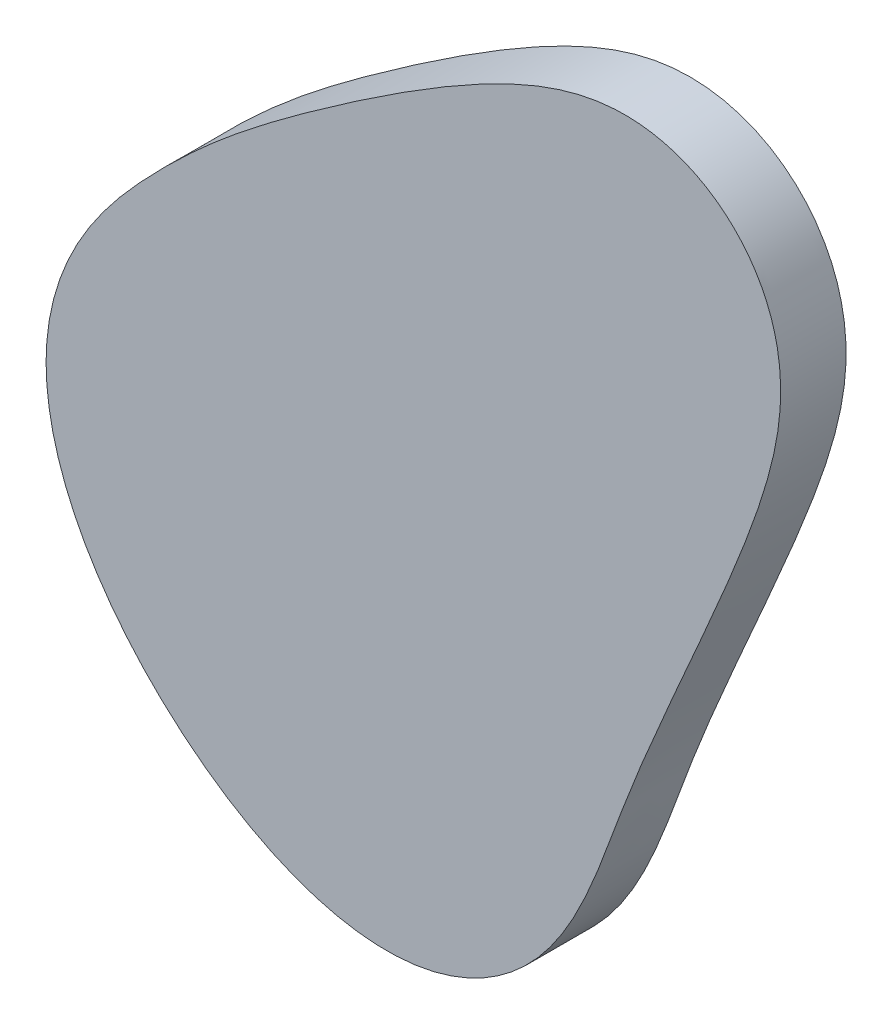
ISO-10303-21;
HEADER;
FILE_DESCRIPTION(('STEP AP214'),'2;1');
FILE_NAME('part.step','',(''),(''),'','','');
FILE_SCHEMA(('AUTOMOTIVE_DESIGN { 1 0 10303 214 1 1 1 1 }'));
ENDSEC;
DATA;
#1=APPLICATION_CONTEXT('core data for automotive mechanical design processes');
#2=APPLICATION_PROTOCOL_DEFINITION('international standard','automotive_design',2000,#1);
#3=PRODUCT_CONTEXT('',#1,'mechanical');
#4=PRODUCT('Part','Part','',(#3));
#5=PRODUCT_RELATED_PRODUCT_CATEGORY('part','',(#4));
#6=PRODUCT_DEFINITION_FORMATION('','',#4);
#7=PRODUCT_DEFINITION_CONTEXT('part definition',#1,'design');
#8=PRODUCT_DEFINITION('design','',#6,#7);
#9=PRODUCT_DEFINITION_SHAPE('','',#8);
#10=(LENGTH_UNIT() NAMED_UNIT(*) SI_UNIT(.MILLI.,.METRE.));
#11=(NAMED_UNIT(*) PLANE_ANGLE_UNIT() SI_UNIT($,.RADIAN.));
#12=(NAMED_UNIT(*) SI_UNIT($,.STERADIAN.) SOLID_ANGLE_UNIT());
#13=UNCERTAINTY_MEASURE_WITH_UNIT(LENGTH_MEASURE(1.E-05),#10,'distance_accuracy_value','');
#14=(GEOMETRIC_REPRESENTATION_CONTEXT(3) GLOBAL_UNCERTAINTY_ASSIGNED_CONTEXT((#13)) GLOBAL_UNIT_ASSIGNED_CONTEXT((#10,
#11,#12)) REPRESENTATION_CONTEXT('',''));
#15=CARTESIAN_POINT('',(0.,0.,0.));
#16=DIRECTION('',(0.,0.,1.));
#17=DIRECTION('',(1.,0.,0.));
#18=AXIS2_PLACEMENT_3D('',#15,#16,#17);
#19=CARTESIAN_POINT('',(62.1111964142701,21.6264947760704,10.));
#20=DIRECTION('',(0.,0.,-1.));
#21=DIRECTION('',(-1.,0.,0.));
#22=AXIS2_PLACEMENT_3D('',#19,#20,#21);
#23=PLANE('',#22);
#24=CARTESIAN_POINT('',(-52.1636509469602,152.439770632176,10.));
#25=CARTESIAN_POINT('',(-51.417355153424,153.050008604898,10.));
#26=CARTESIAN_POINT('',(-50.6710449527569,153.654734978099,10.));
#27=CARTESIAN_POINT('',(-49.1714130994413,154.859471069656,10.));
#28=CARTESIAN_POINT('',(-48.4192989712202,155.458493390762,10.));
#29=CARTESIAN_POINT('',(-46.1564581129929,157.246099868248,10.));
#30=CARTESIAN_POINT('',(-44.6392175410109,158.42520116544,10.));
#31=CARTESIAN_POINT('',(-40.0648236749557,161.929498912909,10.));
#32=CARTESIAN_POINT('',(-36.9850744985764,164.221800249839,10.));
#33=CARTESIAN_POINT('',(-30.7839711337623,168.745834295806,10.));
#34=CARTESIAN_POINT('',(-27.6637072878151,170.979154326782,10.));
#35=CARTESIAN_POINT('',(-21.3933884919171,175.40242446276,10.));
#36=CARTESIAN_POINT('',(-18.2424831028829,177.591136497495,10.));
#37=CARTESIAN_POINT('',(-11.9034679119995,181.914398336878,10.));
#38=CARTESIAN_POINT('',(-8.71539960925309,184.04900855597,10.));
#39=CARTESIAN_POINT('',(-2.29574824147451,188.254880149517,10.));
#40=CARTESIAN_POINT('',(0.936308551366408,190.325451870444,10.));
#41=CARTESIAN_POINT('',(7.45734030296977,194.383733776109,10.));
#42=CARTESIAN_POINT('',(10.7455556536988,196.372549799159,10.));
#43=CARTESIAN_POINT('',(15.7350503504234,199.272543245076,10.));
#44=CARTESIAN_POINT('',(17.4088498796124,200.226075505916,10.));
#45=CARTESIAN_POINT('',(20.7721015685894,202.095818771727,10.));
#46=CARTESIAN_POINT('',(22.4616397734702,203.011942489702,10.));
#47=CARTESIAN_POINT('',(27.5579797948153,205.694619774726,10.));
#48=CARTESIAN_POINT('',(30.9926480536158,207.395145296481,10.));
#49=CARTESIAN_POINT('',(37.971536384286,210.536619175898,10.));
#50=CARTESIAN_POINT('',(41.516999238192,211.974622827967,10.));
#51=CARTESIAN_POINT('',(46.964757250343,213.824633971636,10.));
#52=CARTESIAN_POINT('',(48.8028069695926,214.388867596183,10.));
#53=CARTESIAN_POINT('',(51.6010712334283,215.137621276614,10.));
#54=CARTESIAN_POINT('',(52.5407319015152,215.370842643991,10.));
#55=CARTESIAN_POINT('',(54.4354541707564,215.800793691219,10.));
#56=CARTESIAN_POINT('',(55.3897377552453,215.997191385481,10.));
#57=CARTESIAN_POINT('',(60.1598685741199,216.871016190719,10.));
#58=CARTESIAN_POINT('',(64.0035344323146,217.231640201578,10.));
#59=CARTESIAN_POINT('',(68.8514096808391,217.150807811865,10.));
#60=CARTESIAN_POINT('',(69.8251145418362,217.107852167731,10.));
#61=CARTESIAN_POINT('',(71.7681463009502,216.966266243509,10.));
#62=CARTESIAN_POINT('',(72.7334678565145,216.868023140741,10.));
#63=CARTESIAN_POINT('',(75.6106835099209,216.490207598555,10.));
#64=CARTESIAN_POINT('',(77.5038498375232,216.127643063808,10.));
#65=CARTESIAN_POINT('',(81.238799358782,215.174809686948,10.));
#66=CARTESIAN_POINT('',(83.0805846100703,214.584549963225,10.));
#67=CARTESIAN_POINT('',(85.8027432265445,213.519599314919,10.));
#68=CARTESIAN_POINT('',(86.6998099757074,213.135655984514,10.));
#69=CARTESIAN_POINT('',(88.4566151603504,212.31773295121,10.));
#70=CARTESIAN_POINT('',(89.3189463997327,211.882799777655,10.));
#71=CARTESIAN_POINT('',(91.8580735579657,210.500646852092,10.));
#72=CARTESIAN_POINT('',(93.4871261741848,209.476272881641,10.));
#73=CARTESIAN_POINT('',(95.8343783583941,207.784045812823,10.));
#74=CARTESIAN_POINT('',(96.6007109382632,207.193976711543,10.));
#75=CARTESIAN_POINT('',(98.1006969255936,205.961028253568,10.));
#76=CARTESIAN_POINT('',(98.8367726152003,205.315717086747,10.));
#77=CARTESIAN_POINT('',(100.966391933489,203.324786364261,10.));
#78=CARTESIAN_POINT('',(102.287660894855,201.920491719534,10.));
#79=CARTESIAN_POINT('',(104.741129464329,198.964053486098,10.));
#80=CARTESIAN_POINT('',(105.873509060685,197.412050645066,10.));
#81=CARTESIAN_POINT('',(107.43081455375,194.973580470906,10.));
#82=CARTESIAN_POINT('',(107.92630747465,194.142295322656,10.));
#83=CARTESIAN_POINT('',(108.869425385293,192.44229313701,10.));
#84=CARTESIAN_POINT('',(109.317171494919,191.572692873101,10.));
#85=CARTESIAN_POINT('',(110.570072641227,188.945545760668,10.));
#86=CARTESIAN_POINT('',(111.292180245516,187.157552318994,10.));
#87=CARTESIAN_POINT('',(112.523863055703,183.512896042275,10.));
#88=CARTESIAN_POINT('',(113.033232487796,181.656166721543,10.));
#89=CARTESIAN_POINT('',(113.643697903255,178.821448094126,10.));
#90=CARTESIAN_POINT('',(113.821607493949,177.868277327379,10.));
#91=CARTESIAN_POINT('',(114.126828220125,175.945587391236,10.));
#92=CARTESIAN_POINT('',(114.253553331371,174.980046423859,10.));
#93=CARTESIAN_POINT('',(114.760237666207,170.163517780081,10.));
#94=CARTESIAN_POINT('',(114.765577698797,166.314691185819,10.));
#95=CARTESIAN_POINT('',(114.317244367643,160.546466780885,10.));
#96=CARTESIAN_POINT('',(114.091810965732,158.623660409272,10.));
#97=CARTESIAN_POINT('',(113.511952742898,154.78314349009,10.));
#98=CARTESIAN_POINT('',(113.160270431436,152.880374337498,10.));
#99=CARTESIAN_POINT('',(111.959078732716,147.213456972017,10.));
#100=CARTESIAN_POINT('',(110.965341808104,143.490155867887,10.));
#101=CARTESIAN_POINT('',(108.742337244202,136.110259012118,10.));
#102=CARTESIAN_POINT('',(107.512310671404,132.453878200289,10.));
#103=CARTESIAN_POINT('',(104.906134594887,125.182500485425,10.));
#104=CARTESIAN_POINT('',(103.529132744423,121.567777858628,10.));
#105=CARTESIAN_POINT('',(100.690130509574,114.379701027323,10.));
#106=CARTESIAN_POINT('',(99.227371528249,110.80356126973,10.));
#107=CARTESIAN_POINT('',(96.2483706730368,103.673411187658,10.));
#108=CARTESIAN_POINT('',(94.731703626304,100.119576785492,10.));
#109=CARTESIAN_POINT('',(91.6717267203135,93.0229318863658,10.));
#110=CARTESIAN_POINT('',(90.12750867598,89.4804971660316,10.));
#111=CARTESIAN_POINT('',(85.4810901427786,78.8588882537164,10.));
#112=CARTESIAN_POINT('',(82.3660057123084,71.785045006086,10.));
#113=CARTESIAN_POINT('',(77.7691259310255,61.1429386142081,10.));
#114=CARTESIAN_POINT('',(76.2494913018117,57.5903320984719,10.));
#115=CARTESIAN_POINT('',(73.2556210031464,50.4663344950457,10.));
#116=CARTESIAN_POINT('',(71.7806249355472,46.8952580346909,10.));
#117=CARTESIAN_POINT('',(69.6216897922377,41.5164824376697,10.));
#118=CARTESIAN_POINT('',(68.91109075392,39.7198143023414,10.));
#119=CARTESIAN_POINT('',(67.5119789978,36.1173394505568,10.));
#120=CARTESIAN_POINT('',(66.8247841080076,34.310987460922,10.));
#121=CARTESIAN_POINT('',(64.7895316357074,28.8810361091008,10.));
#122=CARTESIAN_POINT('',(63.463994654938,25.2480657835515,10.));
#123=CARTESIAN_POINT('',(60.7583981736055,18.0049237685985,10.));
#124=CARTESIAN_POINT('',(59.3791468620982,14.3945550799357,10.));
#125=CARTESIAN_POINT('',(56.4435093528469,7.24883059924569,10.));
#126=CARTESIAN_POINT('',(54.8868723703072,3.71358100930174,10.));
#127=CARTESIAN_POINT('',(52.3150275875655,-1.48897573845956,10.));
#128=CARTESIAN_POINT('',(51.4166528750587,-3.20838242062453,10.));
#129=CARTESIAN_POINT('',(49.5366879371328,-6.58033633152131,10.));
#130=CARTESIAN_POINT('',(48.5537151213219,-8.23533053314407,10.));
#131=CARTESIAN_POINT('',(45.4567497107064,-13.0936170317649,10.));
#132=CARTESIAN_POINT('',(43.1933756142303,-16.1892514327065,10.));
#133=CARTESIAN_POINT('',(39.422306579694,-20.56171755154,10.));
#134=CARTESIAN_POINT('',(38.1028297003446,-21.9741963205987,10.));
#135=CARTESIAN_POINT('',(35.323747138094,-24.6981642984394,10.));
#136=CARTESIAN_POINT('',(33.8825390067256,-25.9915101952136,10.));
#137=CARTESIAN_POINT('',(29.4095637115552,-29.6519720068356,10.));
#138=CARTESIAN_POINT('',(26.2248992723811,-31.8039867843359,10.));
#139=CARTESIAN_POINT('',(21.9705575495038,-34.1049632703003,10.));
#140=CARTESIAN_POINT('',(21.105949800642,-34.5456156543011,10.));
#141=CARTESIAN_POINT('',(19.3484522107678,-35.3866920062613,10.));
#142=CARTESIAN_POINT('',(18.4631268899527,-35.7834643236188,10.));
#143=CARTESIAN_POINT('',(15.7904337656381,-36.902772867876,10.));
#144=CARTESIAN_POINT('',(13.9852311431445,-37.5550115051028,10.));
#145=CARTESIAN_POINT('',(8.50134526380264,-39.2376287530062,10.));
#146=CARTESIAN_POINT('',(4.75451651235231,-39.9944406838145,10.));
#147=CARTESIAN_POINT('',(-0.0376938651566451,-40.5041875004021,10.));
#148=CARTESIAN_POINT('',(-1.00160325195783,-40.5841886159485,10.));
#149=CARTESIAN_POINT('',(-2.94030349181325,-40.7005077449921,10.));
#150=CARTESIAN_POINT('',(-3.91333572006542,-40.736589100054,10.));
#151=CARTESIAN_POINT('',(-6.81723118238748,-40.7799062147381,10.));
#152=CARTESIAN_POINT('',(-8.74287406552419,-40.7229892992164,10.));
#153=CARTESIAN_POINT('',(-14.4914324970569,-40.3156368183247,10.));
#154=CARTESIAN_POINT('',(-18.2861580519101,-39.7301025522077,10.));
#155=CARTESIAN_POINT('',(-22.9883898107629,-38.6547922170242,10.));
#156=CARTESIAN_POINT('',(-23.9267658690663,-38.4224643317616,10.));
#157=CARTESIAN_POINT('',(-25.7994989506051,-37.9242906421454,10.));
#158=CARTESIAN_POINT('',(-26.7340689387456,-37.6583334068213,10.));
#159=CARTESIAN_POINT('',(-29.5123237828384,-36.8177758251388,10.));
#160=CARTESIAN_POINT('',(-31.3373365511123,-36.1987472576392,10.));
#161=CARTESIAN_POINT('',(-36.7395936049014,-34.1844608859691,10.));
#162=CARTESIAN_POINT('',(-40.2436462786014,-32.6311160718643,10.));
#163=CARTESIAN_POINT('',(-47.0874051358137,-29.1694534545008,10.));
#164=CARTESIAN_POINT('',(-50.4267844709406,-27.2604296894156,10.));
#165=CARTESIAN_POINT('',(-54.5081246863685,-24.6735293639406,10.));
#166=CARTESIAN_POINT('',(-55.3200401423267,-24.1458381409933,10.));
#167=CARTESIAN_POINT('',(-56.927216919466,-23.0755692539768,10.));
#168=CARTESIAN_POINT('',(-57.723419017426,-22.532409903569,10.));
#169=CARTESIAN_POINT('',(-60.0905397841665,-20.8795886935,10.));
#170=CARTESIAN_POINT('',(-61.6400283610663,-19.7466439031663,10.));
#171=CARTESIAN_POINT('',(-66.2074673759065,-16.2597772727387,10.));
#172=CARTESIAN_POINT('',(-69.1439954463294,-13.8173933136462,10.));
#173=CARTESIAN_POINT('',(-74.8100798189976,-8.70775891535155,10.));
#174=CARTESIAN_POINT('',(-77.5390797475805,-6.0399039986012,10.));
#175=CARTESIAN_POINT('',(-82.7841088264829,-0.472810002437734,10.));
#176=CARTESIAN_POINT('',(-85.2997364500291,2.42686531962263,10.));
#177=CARTESIAN_POINT('',(-88.2980631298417,6.21030840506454,10.));
#178=CARTESIAN_POINT('',(-88.89103232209,6.97593446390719,10.));
#179=CARTESIAN_POINT('',(-90.0568663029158,8.51733581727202,10.));
#180=CARTESIAN_POINT('',(-90.6300190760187,9.29342876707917,10.));
#181=CARTESIAN_POINT('',(-92.3198132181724,11.6380896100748,10.));
#182=CARTESIAN_POINT('',(-95.581294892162,16.3926354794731,10.));
#183=CARTESIAN_POINT('',(-98.4731117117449,21.3513281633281,10.));
#184=CARTESIAN_POINT('',(-101.961983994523,28.1655292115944,10.));
#185=CARTESIAN_POINT('',(-103.522825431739,31.674019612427,10.));
#186=CARTESIAN_POINT('',(-105.205283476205,36.2079630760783,10.));
#187=CARTESIAN_POINT('',(-105.528769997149,37.1238317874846,10.));
#188=CARTESIAN_POINT('',(-106.144343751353,38.9623013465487,10.));
#189=CARTESIAN_POINT('',(-106.436355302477,39.8844675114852,10.));
#190=CARTESIAN_POINT('',(-107.264238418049,42.6599135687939,10.));
#191=CARTESIAN_POINT('',(-107.752072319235,44.5221198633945,10.));
#192=CARTESIAN_POINT('',(-109.015964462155,50.1458303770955,10.));
#193=CARTESIAN_POINT('',(-109.592394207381,53.9444297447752,10.));
#194=CARTESIAN_POINT('',(-109.940797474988,58.7618292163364,10.));
#195=CARTESIAN_POINT('',(-109.991789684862,59.7287818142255,10.));
#196=CARTESIAN_POINT('',(-110.055055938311,61.6698816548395,10.));
#197=CARTESIAN_POINT('',(-110.067159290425,62.6422216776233,10.));
#198=CARTESIAN_POINT('',(-110.044305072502,65.5425307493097,10.));
#199=CARTESIAN_POINT('',(-109.950320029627,67.4621766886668,10.));
#200=CARTESIAN_POINT('',(-109.435235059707,73.1799840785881,10.));
#201=CARTESIAN_POINT('',(-108.783421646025,76.9374414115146,10.));
#202=CARTESIAN_POINT('',(-107.3697968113,82.4967219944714,10.));
#203=CARTESIAN_POINT('',(-106.82577759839,84.3369696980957,10.));
#204=CARTESIAN_POINT('',(-105.902584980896,87.0784346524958,10.));
#205=CARTESIAN_POINT('',(-105.576996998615,87.9891058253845,10.));
#206=CARTESIAN_POINT('',(-104.890523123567,89.8042206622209,10.));
#207=CARTESIAN_POINT('',(-104.531002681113,90.7048969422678,10.));
#208=CARTESIAN_POINT('',(-102.660852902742,95.1610480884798,10.));
#209=CARTESIAN_POINT('',(-100.927353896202,98.5899466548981,10.));
#210=CARTESIAN_POINT('',(-97.0656449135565,105.221567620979,10.));
#211=CARTESIAN_POINT('',(-94.936347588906,108.423666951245,10.));
#212=CARTESIAN_POINT('',(-91.5021986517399,113.089175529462,10.));
#213=CARTESIAN_POINT('',(-90.3165221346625,114.622309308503,10.));
#214=CARTESIAN_POINT('',(-87.8932651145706,117.625873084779,10.));
#215=CARTESIAN_POINT('',(-86.6534630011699,119.09944698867,10.));
#216=CARTESIAN_POINT('',(-82.8654341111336,123.451462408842,10.));
#217=CARTESIAN_POINT('',(-80.2497383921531,126.262352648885,10.));
#218=CARTESIAN_POINT('',(-74.9264577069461,131.792131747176,10.));
#219=CARTESIAN_POINT('',(-72.212386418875,134.504526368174,10.));
#220=CARTESIAN_POINT('',(-66.6728957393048,139.817831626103,10.));
#221=CARTESIAN_POINT('',(-63.8467109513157,142.417975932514,10.));
#222=CARTESIAN_POINT('',(-58.0842966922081,147.508085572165,10.));
#223=CARTESIAN_POINT('',(-55.1488341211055,149.998818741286,10.));
#224=CARTESIAN_POINT('',(-52.1636509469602,152.439770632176,10.));
#225=B_SPLINE_CURVE_WITH_KNOTS('',3,(#24,#25,#26,#27,#28,#29,#30,#31,#32,#33,#34,#35,#36,#37,
#38,#39,#40,#41,#42,#43,#44,#45,#46,#47,#48,#49,#50,#51,#52,#53,#54,#55,#56,#57,#58,#59,#60,#61,
#62,#63,#64,#65,#66,#67,#68,#69,#70,#71,#72,#73,#74,#75,#76,#77,#78,#79,#80,#81,#82,#83,#84,#85,
#86,#87,#88,#89,#90,#91,#92,#93,#94,#95,#96,#97,#98,#99,#100,#101,#102,#103,#104,#105,#106,#107,
#108,#109,#110,#111,#112,#113,#114,#115,#116,#117,#118,#119,#120,#121,#122,#123,#124,#125,#126,
#127,#128,#129,#130,#131,#132,#133,#134,#135,#136,#137,#138,#139,#140,#141,#142,#143,#144,#145,
#146,#147,#148,#149,#150,#151,#152,#153,#154,#155,#156,#157,#158,#159,#160,#161,#162,#163,#164,
#165,#166,#167,#168,#169,#170,#171,#172,#173,#174,#175,#176,#177,#178,#179,#180,#181,#182,#183,
#184,#185,#186,#187,#188,#189,#190,#191,#192,#193,#194,#195,#196,#197,#198,#199,#200,#201,#202,
#203,#204,#205,#206,#207,#208,#209,#210,#211,#212,#213,#214,#215,#216,#217,#218,#219,#220,#221,
#222,#223,#224),.UNSPECIFIED.,.T.,.F.,(4,2,2,2,2,2,2,2,2,2,2,2,2,2,2,2,2,2,2,2,2,2,2,2,2,2,2,2,
2,2,2,2,2,2,2,2,2,2,2,2,2,2,2,2,2,2,2,2,2,2,2,2,2,2,2,2,2,2,2,2,2,2,2,2,2,2,2,2,2,2,2,2,2,2,2,2,
2,2,2,1,2,2,2,2,2,2,2,2,2,2,2,2,2,2,2,2,2,2,2,2,4),(0.,0.00390624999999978,0.00781249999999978,
0.0156249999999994,0.0312499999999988,0.046874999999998,0.0624999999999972,0.0781249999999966,
0.0937499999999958,0.109374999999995,0.117187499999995,0.124999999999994,0.140624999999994,
0.156249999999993,0.164062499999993,0.167968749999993,0.171874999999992,0.187499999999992,
0.191406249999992,0.195312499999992,0.203124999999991,0.210937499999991,0.214843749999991,
0.218749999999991,0.226562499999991,0.230468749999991,0.234374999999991,0.242187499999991,
0.24999999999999,0.253906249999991,0.257812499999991,0.265624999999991,0.273437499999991,
0.277343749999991,0.281249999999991,0.296874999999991,0.304687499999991,0.312499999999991,
0.328124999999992,0.343749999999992,0.359374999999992,0.374999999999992,0.390624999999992,
0.406249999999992,0.437499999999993,0.453124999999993,0.468749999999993,0.476562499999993,
0.484374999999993,0.499999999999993,0.515624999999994,0.531249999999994,0.539062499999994,
0.546874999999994,0.562499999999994,0.570312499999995,0.578124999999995,0.593749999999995,
0.597656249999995,0.601562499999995,0.609374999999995,0.624999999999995,0.628906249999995,
0.632812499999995,0.640624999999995,0.656249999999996,0.660156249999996,0.664062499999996,
0.671874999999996,0.687499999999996,0.703124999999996,0.707031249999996,0.710937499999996,
0.718749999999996,0.734374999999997,0.749999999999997,0.765624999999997,0.769531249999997,
0.773437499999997,0.781249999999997,0.796874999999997,0.812499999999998,0.816406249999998,
0.820312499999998,0.828124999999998,0.843749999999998,0.847656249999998,0.851562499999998,
0.859374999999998,0.874999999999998,0.882812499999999,0.886718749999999,0.890624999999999,
0.906249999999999,0.921874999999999,0.929687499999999,0.937499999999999,0.953125,0.96875,
0.984375,1.),.UNSPECIFIED.);
#226=CARTESIAN_POINT('',(-52.1636509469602,152.439770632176,10.));
#227=VERTEX_POINT('',#226);
#228=EDGE_CURVE('E11',#227,#227,#225,.F.);
#229=ORIENTED_EDGE('',*,*,#228,.T.);
#230=EDGE_LOOP('',(#229));
#231=FACE_BOUND('',#230,.T.);
#232=ADVANCED_FACE('F45',(#231),#23,.F.);
#233=CARTESIAN_POINT('',(62.1111964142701,21.6264947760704,-10.));
#234=DIRECTION('',(0.,0.,-1.));
#235=DIRECTION('',(-1.,0.,0.));
#236=AXIS2_PLACEMENT_3D('',#233,#234,#235);
#237=PLANE('',#236);
#238=CARTESIAN_POINT('',(-52.1636509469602,152.439770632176,-9.99999999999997));
#239=CARTESIAN_POINT('',(-55.1488341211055,149.998818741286,-9.99999999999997));
#240=CARTESIAN_POINT('',(-58.0842966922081,147.508085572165,-9.99999999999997));
#241=CARTESIAN_POINT('',(-63.8467109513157,142.417975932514,-9.99999999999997));
#242=CARTESIAN_POINT('',(-66.6728957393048,139.817831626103,-9.99999999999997));
#243=CARTESIAN_POINT('',(-72.212386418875,134.504526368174,-9.99999999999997));
#244=CARTESIAN_POINT('',(-74.9264577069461,131.792131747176,-9.99999999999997));
#245=CARTESIAN_POINT('',(-80.2497383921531,126.262352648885,-9.99999999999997));
#246=CARTESIAN_POINT('',(-82.8654341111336,123.451462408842,-9.99999999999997));
#247=CARTESIAN_POINT('',(-86.6534630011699,119.09944698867,-9.99999999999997));
#248=CARTESIAN_POINT('',(-87.8932651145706,117.625873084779,-9.99999999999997));
#249=CARTESIAN_POINT('',(-90.3165221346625,114.622309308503,-9.99999999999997));
#250=CARTESIAN_POINT('',(-91.5021986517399,113.089175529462,-9.99999999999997));
#251=CARTESIAN_POINT('',(-94.936347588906,108.423666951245,-9.99999999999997));
#252=CARTESIAN_POINT('',(-97.0656449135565,105.221567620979,-9.99999999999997));
#253=CARTESIAN_POINT('',(-100.927353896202,98.5899466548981,-9.99999999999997));
#254=CARTESIAN_POINT('',(-102.660852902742,95.1610480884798,-9.99999999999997));
#255=CARTESIAN_POINT('',(-104.531002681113,90.7048969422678,-9.99999999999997));
#256=CARTESIAN_POINT('',(-104.890523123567,89.8042206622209,-9.99999999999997));
#257=CARTESIAN_POINT('',(-105.576996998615,87.9891058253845,-9.99999999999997));
#258=CARTESIAN_POINT('',(-105.902584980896,87.0784346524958,-9.99999999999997));
#259=CARTESIAN_POINT('',(-106.82577759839,84.3369696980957,-9.99999999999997));
#260=CARTESIAN_POINT('',(-107.3697968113,82.4967219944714,-9.99999999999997));
#261=CARTESIAN_POINT('',(-108.783421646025,76.9374414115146,-9.99999999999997));
#262=CARTESIAN_POINT('',(-109.435235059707,73.1799840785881,-9.99999999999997));
#263=CARTESIAN_POINT('',(-109.950320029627,67.4621766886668,-9.99999999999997));
#264=CARTESIAN_POINT('',(-110.044305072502,65.5425307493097,-9.99999999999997));
#265=CARTESIAN_POINT('',(-110.067159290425,62.6422216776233,-9.99999999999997));
#266=CARTESIAN_POINT('',(-110.055055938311,61.6698816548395,-9.99999999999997));
#267=CARTESIAN_POINT('',(-109.991789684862,59.7287818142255,-9.99999999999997));
#268=CARTESIAN_POINT('',(-109.940797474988,58.7618292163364,-9.99999999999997));
#269=CARTESIAN_POINT('',(-109.592394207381,53.9444297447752,-9.99999999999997));
#270=CARTESIAN_POINT('',(-109.015964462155,50.1458303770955,-9.99999999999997));
#271=CARTESIAN_POINT('',(-107.752072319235,44.5221198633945,-9.99999999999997));
#272=CARTESIAN_POINT('',(-107.264238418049,42.6599135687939,-9.99999999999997));
#273=CARTESIAN_POINT('',(-106.436355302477,39.8844675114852,-9.99999999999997));
#274=CARTESIAN_POINT('',(-106.144343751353,38.9623013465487,-9.99999999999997));
#275=CARTESIAN_POINT('',(-105.528769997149,37.1238317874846,-9.99999999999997));
#276=CARTESIAN_POINT('',(-105.205283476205,36.2079630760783,-9.99999999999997));
#277=CARTESIAN_POINT('',(-103.522825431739,31.674019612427,-9.99999999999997));
#278=CARTESIAN_POINT('',(-101.961983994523,28.1655292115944,-9.99999999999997));
#279=CARTESIAN_POINT('',(-98.4731117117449,21.3513281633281,-9.99999999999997));
#280=CARTESIAN_POINT('',(-95.581294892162,16.3926354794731,-9.99999999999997));
#281=CARTESIAN_POINT('',(-92.3198132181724,11.6380896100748,-9.99999999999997));
#282=CARTESIAN_POINT('',(-90.6300190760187,9.29342876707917,-9.99999999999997));
#283=CARTESIAN_POINT('',(-90.0568663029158,8.51733581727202,-9.99999999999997));
#284=CARTESIAN_POINT('',(-88.89103232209,6.97593446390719,-9.99999999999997));
#285=CARTESIAN_POINT('',(-88.2980631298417,6.21030840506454,-9.99999999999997));
#286=CARTESIAN_POINT('',(-85.2997364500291,2.42686531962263,-9.99999999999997));
#287=CARTESIAN_POINT('',(-82.7841088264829,-0.472810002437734,-9.99999999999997));
#288=CARTESIAN_POINT('',(-77.5390797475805,-6.0399039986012,-9.99999999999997));
#289=CARTESIAN_POINT('',(-74.8100798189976,-8.70775891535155,-9.99999999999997));
#290=CARTESIAN_POINT('',(-69.1439954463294,-13.8173933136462,-9.99999999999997));
#291=CARTESIAN_POINT('',(-66.2074673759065,-16.2597772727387,-9.99999999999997));
#292=CARTESIAN_POINT('',(-61.6400283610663,-19.7466439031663,-9.99999999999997));
#293=CARTESIAN_POINT('',(-60.0905397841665,-20.8795886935,-9.99999999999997));
#294=CARTESIAN_POINT('',(-57.723419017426,-22.532409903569,-9.99999999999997));
#295=CARTESIAN_POINT('',(-56.927216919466,-23.0755692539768,-9.99999999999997));
#296=CARTESIAN_POINT('',(-55.3200401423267,-24.1458381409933,-9.99999999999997));
#297=CARTESIAN_POINT('',(-54.5081246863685,-24.6735293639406,-9.99999999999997));
#298=CARTESIAN_POINT('',(-50.4267844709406,-27.2604296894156,-9.99999999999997));
#299=CARTESIAN_POINT('',(-47.0874051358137,-29.1694534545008,-9.99999999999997));
#300=CARTESIAN_POINT('',(-40.2436462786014,-32.6311160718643,-9.99999999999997));
#301=CARTESIAN_POINT('',(-36.7395936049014,-34.1844608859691,-9.99999999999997));
#302=CARTESIAN_POINT('',(-31.3373365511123,-36.1987472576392,-9.99999999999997));
#303=CARTESIAN_POINT('',(-29.5123237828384,-36.8177758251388,-9.99999999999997));
#304=CARTESIAN_POINT('',(-26.7340689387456,-37.6583334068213,-9.99999999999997));
#305=CARTESIAN_POINT('',(-25.7994989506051,-37.9242906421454,-9.99999999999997));
#306=CARTESIAN_POINT('',(-23.9267658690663,-38.4224643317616,-9.99999999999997));
#307=CARTESIAN_POINT('',(-22.9883898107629,-38.6547922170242,-9.99999999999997));
#308=CARTESIAN_POINT('',(-18.2861580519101,-39.7301025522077,-9.99999999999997));
#309=CARTESIAN_POINT('',(-14.4914324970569,-40.3156368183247,-9.99999999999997));
#310=CARTESIAN_POINT('',(-8.74287406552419,-40.7229892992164,-9.99999999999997));
#311=CARTESIAN_POINT('',(-6.81723118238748,-40.7799062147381,-9.99999999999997));
#312=CARTESIAN_POINT('',(-3.91333572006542,-40.736589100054,-9.99999999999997));
#313=CARTESIAN_POINT('',(-2.94030349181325,-40.7005077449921,-9.99999999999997));
#314=CARTESIAN_POINT('',(-1.00160325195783,-40.5841886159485,-9.99999999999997));
#315=CARTESIAN_POINT('',(-0.0376938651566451,-40.5041875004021,-9.99999999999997));
#316=CARTESIAN_POINT('',(4.75451651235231,-39.9944406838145,-9.99999999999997));
#317=CARTESIAN_POINT('',(8.50134526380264,-39.2376287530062,-9.99999999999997));
#318=CARTESIAN_POINT('',(13.9852311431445,-37.5550115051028,-9.99999999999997));
#319=CARTESIAN_POINT('',(15.7904337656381,-36.902772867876,-9.99999999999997));
#320=CARTESIAN_POINT('',(18.4631268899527,-35.7834643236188,-9.99999999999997));
#321=CARTESIAN_POINT('',(19.3484522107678,-35.3866920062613,-9.99999999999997));
#322=CARTESIAN_POINT('',(21.105949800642,-34.5456156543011,-9.99999999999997));
#323=CARTESIAN_POINT('',(21.9705575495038,-34.1049632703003,-9.99999999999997));
#324=CARTESIAN_POINT('',(26.2248992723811,-31.8039867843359,-9.99999999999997));
#325=CARTESIAN_POINT('',(29.4095637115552,-29.6519720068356,-9.99999999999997));
#326=CARTESIAN_POINT('',(33.8825390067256,-25.9915101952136,-9.99999999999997));
#327=CARTESIAN_POINT('',(35.323747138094,-24.6981642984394,-9.99999999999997));
#328=CARTESIAN_POINT('',(38.1028297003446,-21.9741963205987,-9.99999999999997));
#329=CARTESIAN_POINT('',(39.422306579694,-20.56171755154,-9.99999999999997));
#330=CARTESIAN_POINT('',(43.1933756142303,-16.1892514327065,-9.99999999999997));
#331=CARTESIAN_POINT('',(45.4567497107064,-13.0936170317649,-9.99999999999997));
#332=CARTESIAN_POINT('',(48.5537151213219,-8.23533053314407,-9.99999999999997));
#333=CARTESIAN_POINT('',(49.5366879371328,-6.58033633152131,-9.99999999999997));
#334=CARTESIAN_POINT('',(51.4166528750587,-3.20838242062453,-9.99999999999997));
#335=CARTESIAN_POINT('',(52.3150275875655,-1.48897573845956,-9.99999999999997));
#336=CARTESIAN_POINT('',(54.8868723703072,3.71358100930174,-9.99999999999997));
#337=CARTESIAN_POINT('',(56.4435093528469,7.24883059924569,-9.99999999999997));
#338=CARTESIAN_POINT('',(59.3791468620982,14.3945550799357,-9.99999999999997));
#339=CARTESIAN_POINT('',(60.7583981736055,18.0049237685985,-9.99999999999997));
#340=CARTESIAN_POINT('',(63.463994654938,25.2480657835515,-9.99999999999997));
#341=CARTESIAN_POINT('',(64.7895316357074,28.8810361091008,-9.99999999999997));
#342=CARTESIAN_POINT('',(66.8247841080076,34.310987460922,-9.99999999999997));
#343=CARTESIAN_POINT('',(67.5119789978,36.1173394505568,-9.99999999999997));
#344=CARTESIAN_POINT('',(68.91109075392,39.7198143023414,-9.99999999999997));
#345=CARTESIAN_POINT('',(69.6216897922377,41.5164824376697,-9.99999999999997));
#346=CARTESIAN_POINT('',(71.7806249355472,46.8952580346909,-9.99999999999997));
#347=CARTESIAN_POINT('',(73.2556210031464,50.4663344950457,-9.99999999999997));
#348=CARTESIAN_POINT('',(76.2494913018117,57.5903320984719,-9.99999999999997));
#349=CARTESIAN_POINT('',(77.7691259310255,61.1429386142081,-9.99999999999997));
#350=CARTESIAN_POINT('',(82.3660057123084,71.785045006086,-9.99999999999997));
#351=CARTESIAN_POINT('',(85.4810901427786,78.8588882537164,-9.99999999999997));
#352=CARTESIAN_POINT('',(90.12750867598,89.4804971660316,-9.99999999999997));
#353=CARTESIAN_POINT('',(91.6717267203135,93.0229318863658,-9.99999999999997));
#354=CARTESIAN_POINT('',(94.731703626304,100.119576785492,-9.99999999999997));
#355=CARTESIAN_POINT('',(96.2483706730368,103.673411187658,-9.99999999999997));
#356=CARTESIAN_POINT('',(99.227371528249,110.80356126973,-9.99999999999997));
#357=CARTESIAN_POINT('',(100.690130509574,114.379701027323,-9.99999999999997));
#358=CARTESIAN_POINT('',(103.529132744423,121.567777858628,-9.99999999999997));
#359=CARTESIAN_POINT('',(104.906134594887,125.182500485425,-9.99999999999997));
#360=CARTESIAN_POINT('',(107.512310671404,132.453878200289,-9.99999999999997));
#361=CARTESIAN_POINT('',(108.742337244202,136.110259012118,-9.99999999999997));
#362=CARTESIAN_POINT('',(110.965341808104,143.490155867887,-9.99999999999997));
#363=CARTESIAN_POINT('',(111.959078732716,147.213456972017,-9.99999999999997));
#364=CARTESIAN_POINT('',(113.160270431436,152.880374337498,-9.99999999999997));
#365=CARTESIAN_POINT('',(113.511952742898,154.78314349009,-9.99999999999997));
#366=CARTESIAN_POINT('',(114.091810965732,158.623660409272,-9.99999999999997));
#367=CARTESIAN_POINT('',(114.317244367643,160.546466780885,-9.99999999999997));
#368=CARTESIAN_POINT('',(114.765577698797,166.314691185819,-9.99999999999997));
#369=CARTESIAN_POINT('',(114.760237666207,170.163517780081,-9.99999999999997));
#370=CARTESIAN_POINT('',(114.253553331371,174.980046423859,-9.99999999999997));
#371=CARTESIAN_POINT('',(114.126828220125,175.945587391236,-9.99999999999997));
#372=CARTESIAN_POINT('',(113.821607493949,177.868277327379,-9.99999999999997));
#373=CARTESIAN_POINT('',(113.643697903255,178.821448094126,-9.99999999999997));
#374=CARTESIAN_POINT('',(113.033232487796,181.656166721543,-9.99999999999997));
#375=CARTESIAN_POINT('',(112.523863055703,183.512896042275,-9.99999999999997));
#376=CARTESIAN_POINT('',(111.292180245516,187.157552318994,-9.99999999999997));
#377=CARTESIAN_POINT('',(110.570072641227,188.945545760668,-9.99999999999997));
#378=CARTESIAN_POINT('',(109.317171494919,191.572692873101,-9.99999999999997));
#379=CARTESIAN_POINT('',(108.869425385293,192.44229313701,-9.99999999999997));
#380=CARTESIAN_POINT('',(107.92630747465,194.142295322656,-9.99999999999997));
#381=CARTESIAN_POINT('',(107.43081455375,194.973580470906,-9.99999999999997));
#382=CARTESIAN_POINT('',(105.873509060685,197.412050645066,-9.99999999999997));
#383=CARTESIAN_POINT('',(104.741129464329,198.964053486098,-9.99999999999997));
#384=CARTESIAN_POINT('',(102.287660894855,201.920491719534,-9.99999999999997));
#385=CARTESIAN_POINT('',(100.966391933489,203.324786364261,-9.99999999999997));
#386=CARTESIAN_POINT('',(98.8367726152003,205.315717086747,-9.99999999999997));
#387=CARTESIAN_POINT('',(98.1006969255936,205.961028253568,-9.99999999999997));
#388=CARTESIAN_POINT('',(96.6007109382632,207.193976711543,-9.99999999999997));
#389=CARTESIAN_POINT('',(95.8343783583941,207.784045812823,-9.99999999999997));
#390=CARTESIAN_POINT('',(93.4871261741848,209.476272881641,-9.99999999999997));
#391=CARTESIAN_POINT('',(91.8580735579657,210.500646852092,-9.99999999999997));
#392=CARTESIAN_POINT('',(89.3189463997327,211.882799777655,-9.99999999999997));
#393=CARTESIAN_POINT('',(88.4566151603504,212.31773295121,-9.99999999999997));
#394=CARTESIAN_POINT('',(86.6998099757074,213.135655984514,-9.99999999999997));
#395=CARTESIAN_POINT('',(85.8027432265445,213.519599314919,-9.99999999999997));
#396=CARTESIAN_POINT('',(83.0805846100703,214.584549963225,-9.99999999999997));
#397=CARTESIAN_POINT('',(81.238799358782,215.174809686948,-9.99999999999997));
#398=CARTESIAN_POINT('',(77.5038498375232,216.127643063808,-9.99999999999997));
#399=CARTESIAN_POINT('',(75.6106835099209,216.490207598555,-9.99999999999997));
#400=CARTESIAN_POINT('',(72.7334678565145,216.868023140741,-9.99999999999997));
#401=CARTESIAN_POINT('',(71.7681463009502,216.966266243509,-9.99999999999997));
#402=CARTESIAN_POINT('',(69.8251145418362,217.107852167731,-9.99999999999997));
#403=CARTESIAN_POINT('',(68.8514096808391,217.150807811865,-9.99999999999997));
#404=CARTESIAN_POINT('',(64.0035344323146,217.231640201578,-9.99999999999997));
#405=CARTESIAN_POINT('',(60.1598685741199,216.871016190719,-9.99999999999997));
#406=CARTESIAN_POINT('',(55.3897377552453,215.997191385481,-9.99999999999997));
#407=CARTESIAN_POINT('',(54.4354541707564,215.800793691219,-9.99999999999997));
#408=CARTESIAN_POINT('',(52.5407319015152,215.370842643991,-9.99999999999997));
#409=CARTESIAN_POINT('',(51.6010712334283,215.137621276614,-9.99999999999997));
#410=CARTESIAN_POINT('',(48.8028069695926,214.388867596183,-9.99999999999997));
#411=CARTESIAN_POINT('',(46.964757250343,213.824633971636,-9.99999999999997));
#412=CARTESIAN_POINT('',(41.516999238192,211.974622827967,-9.99999999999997));
#413=CARTESIAN_POINT('',(37.971536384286,210.536619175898,-9.99999999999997));
#414=CARTESIAN_POINT('',(30.9926480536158,207.395145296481,-9.99999999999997));
#415=CARTESIAN_POINT('',(27.5579797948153,205.694619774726,-9.99999999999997));
#416=CARTESIAN_POINT('',(22.4616397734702,203.011942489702,-9.99999999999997));
#417=CARTESIAN_POINT('',(20.7721015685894,202.095818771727,-9.99999999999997));
#418=CARTESIAN_POINT('',(17.4088498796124,200.226075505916,-9.99999999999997));
#419=CARTESIAN_POINT('',(15.7350503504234,199.272543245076,-9.99999999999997));
#420=CARTESIAN_POINT('',(10.7455556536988,196.372549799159,-9.99999999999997));
#421=CARTESIAN_POINT('',(7.45734030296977,194.383733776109,-9.99999999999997));
#422=CARTESIAN_POINT('',(0.936308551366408,190.325451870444,-9.99999999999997));
#423=CARTESIAN_POINT('',(-2.29574824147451,188.254880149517,-9.99999999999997));
#424=CARTESIAN_POINT('',(-8.71539960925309,184.04900855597,-9.99999999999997));
#425=CARTESIAN_POINT('',(-11.9034679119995,181.914398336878,-9.99999999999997));
#426=CARTESIAN_POINT('',(-18.2424831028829,177.591136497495,-9.99999999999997));
#427=CARTESIAN_POINT('',(-21.3933884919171,175.40242446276,-9.99999999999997));
#428=CARTESIAN_POINT('',(-27.6637072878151,170.979154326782,-9.99999999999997));
#429=CARTESIAN_POINT('',(-30.7839711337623,168.745834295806,-9.99999999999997));
#430=CARTESIAN_POINT('',(-36.9850744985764,164.221800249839,-9.99999999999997));
#431=CARTESIAN_POINT('',(-40.0648236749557,161.929498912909,-9.99999999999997));
#432=CARTESIAN_POINT('',(-44.6392175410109,158.42520116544,-9.99999999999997));
#433=CARTESIAN_POINT('',(-46.1564581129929,157.246099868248,-9.99999999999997));
#434=CARTESIAN_POINT('',(-48.4192989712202,155.458493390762,-9.99999999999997));
#435=CARTESIAN_POINT('',(-49.1714130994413,154.859471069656,-9.99999999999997));
#436=CARTESIAN_POINT('',(-50.6710449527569,153.654734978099,-9.99999999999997));
#437=CARTESIAN_POINT('',(-51.417355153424,153.050008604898,-9.99999999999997));
#438=CARTESIAN_POINT('',(-52.1636509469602,152.439770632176,-9.99999999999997));
#439=B_SPLINE_CURVE_WITH_KNOTS('',3,(#238,#239,#240,#241,#242,#243,#244,#245,#246,#247,#248,
#249,#250,#251,#252,#253,#254,#255,#256,#257,#258,#259,#260,#261,#262,#263,#264,#265,#266,#267,
#268,#269,#270,#271,#272,#273,#274,#275,#276,#277,#278,#279,#280,#281,#282,#283,#284,#285,#286,
#287,#288,#289,#290,#291,#292,#293,#294,#295,#296,#297,#298,#299,#300,#301,#302,#303,#304,#305,
#306,#307,#308,#309,#310,#311,#312,#313,#314,#315,#316,#317,#318,#319,#320,#321,#322,#323,#324,
#325,#326,#327,#328,#329,#330,#331,#332,#333,#334,#335,#336,#337,#338,#339,#340,#341,#342,#343,
#344,#345,#346,#347,#348,#349,#350,#351,#352,#353,#354,#355,#356,#357,#358,#359,#360,#361,#362,
#363,#364,#365,#366,#367,#368,#369,#370,#371,#372,#373,#374,#375,#376,#377,#378,#379,#380,#381,
#382,#383,#384,#385,#386,#387,#388,#389,#390,#391,#392,#393,#394,#395,#396,#397,#398,#399,#400,
#401,#402,#403,#404,#405,#406,#407,#408,#409,#410,#411,#412,#413,#414,#415,#416,#417,#418,#419,
#420,#421,#422,#423,#424,#425,#426,#427,#428,#429,#430,#431,#432,#433,#434,#435,#436,#437,#438),
.UNSPECIFIED.,.T.,.F.,(4,2,2,2,2,2,2,2,2,2,2,2,2,2,2,2,2,2,2,2,2,1,2,2,2,2,2,2,2,2,2,2,2,2,2,2,
2,2,2,2,2,2,2,2,2,2,2,2,2,2,2,2,2,2,2,2,2,2,2,2,2,2,2,2,2,2,2,2,2,2,2,2,2,2,2,2,2,2,2,2,2,2,2,2,
2,2,2,2,2,2,2,2,2,2,2,2,2,2,2,2,4),(0.,0.0156250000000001,0.0312500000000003,0.0468750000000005,
0.0625000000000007,0.0703125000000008,0.0781250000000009,0.0937500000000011,0.109375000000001,
0.113281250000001,0.117187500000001,0.125000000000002,0.140625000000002,0.148437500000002,
0.152343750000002,0.156250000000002,0.171875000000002,0.179687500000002,0.183593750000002,
0.187500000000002,0.203125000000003,0.218750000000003,0.226562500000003,0.230468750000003,
0.234375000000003,0.250000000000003,0.265625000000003,0.281250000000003,0.289062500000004,
0.292968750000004,0.296875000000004,0.312500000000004,0.328125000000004,0.335937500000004,
0.339843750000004,0.343750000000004,0.359375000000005,0.367187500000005,0.371093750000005,
0.375000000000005,0.390625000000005,0.398437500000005,0.402343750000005,0.406250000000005,
0.421875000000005,0.429687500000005,0.437500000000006,0.453125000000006,0.460937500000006,
0.468750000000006,0.484375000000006,0.500000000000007,0.515625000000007,0.523437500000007,
0.531250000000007,0.546875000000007,0.562500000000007,0.593750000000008,0.609375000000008,
0.625000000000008,0.640625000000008,0.656250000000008,0.671875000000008,0.687500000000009,
0.695312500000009,0.703125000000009,0.718750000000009,0.722656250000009,0.726562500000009,
0.734375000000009,0.742187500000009,0.746093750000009,0.75000000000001,0.757812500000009,
0.765625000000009,0.769531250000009,0.773437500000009,0.781250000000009,0.785156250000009,
0.789062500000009,0.796875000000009,0.804687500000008,0.808593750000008,0.812500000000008,
0.828125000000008,0.832031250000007,0.835937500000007,0.843750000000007,0.859375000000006,
0.875000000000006,0.882812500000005,0.890625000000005,0.906250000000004,0.921875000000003,
0.937500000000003,0.953125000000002,0.968750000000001,0.984375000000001,0.9921875,0.99609375,
1.),.UNSPECIFIED.);
#440=CARTESIAN_POINT('',(-52.1636509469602,152.439770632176,-9.99999999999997));
#441=VERTEX_POINT('',#440);
#442=EDGE_CURVE('E57',#441,#441,#439,.T.);
#443=ORIENTED_EDGE('',*,*,#442,.F.);
#444=EDGE_LOOP('',(#443));
#445=FACE_BOUND('',#444,.T.);
#446=ADVANCED_FACE('F94',(#445),#237,.T.);
#447=CARTESIAN_POINT('',(-52.1636509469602,152.439770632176,10.));
#448=CARTESIAN_POINT('',(-55.1488341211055,149.998818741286,10.));
#449=CARTESIAN_POINT('',(-58.0842966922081,147.508085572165,10.));
#450=CARTESIAN_POINT('',(-63.8467109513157,142.417975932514,10.));
#451=CARTESIAN_POINT('',(-66.6728957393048,139.817831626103,10.));
#452=CARTESIAN_POINT('',(-72.212386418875,134.504526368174,10.));
#453=CARTESIAN_POINT('',(-74.9264577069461,131.792131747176,10.));
#454=CARTESIAN_POINT('',(-80.2497383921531,126.262352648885,10.));
#455=CARTESIAN_POINT('',(-82.8654341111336,123.451462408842,10.));
#456=CARTESIAN_POINT('',(-86.6534630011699,119.09944698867,10.));
#457=CARTESIAN_POINT('',(-87.8932651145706,117.625873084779,10.));
#458=CARTESIAN_POINT('',(-90.3165221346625,114.622309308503,10.));
#459=CARTESIAN_POINT('',(-91.5021986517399,113.089175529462,10.));
#460=CARTESIAN_POINT('',(-94.936347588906,108.423666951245,10.));
#461=CARTESIAN_POINT('',(-97.0656449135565,105.221567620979,10.));
#462=CARTESIAN_POINT('',(-100.927353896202,98.5899466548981,10.));
#463=CARTESIAN_POINT('',(-102.660852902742,95.1610480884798,10.));
#464=CARTESIAN_POINT('',(-104.531002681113,90.7048969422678,10.));
#465=CARTESIAN_POINT('',(-104.890523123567,89.8042206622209,10.));
#466=CARTESIAN_POINT('',(-105.576996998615,87.9891058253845,10.));
#467=CARTESIAN_POINT('',(-105.902584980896,87.0784346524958,10.));
#468=CARTESIAN_POINT('',(-106.82577759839,84.3369696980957,10.));
#469=CARTESIAN_POINT('',(-107.3697968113,82.4967219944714,10.));
#470=CARTESIAN_POINT('',(-108.783421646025,76.9374414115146,10.));
#471=CARTESIAN_POINT('',(-109.435235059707,73.1799840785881,10.));
#472=CARTESIAN_POINT('',(-109.950320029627,67.4621766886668,10.));
#473=CARTESIAN_POINT('',(-110.044305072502,65.5425307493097,10.));
#474=CARTESIAN_POINT('',(-110.067159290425,62.6422216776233,10.));
#475=CARTESIAN_POINT('',(-110.055055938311,61.6698816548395,10.));
#476=CARTESIAN_POINT('',(-109.991789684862,59.7287818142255,10.));
#477=CARTESIAN_POINT('',(-109.940797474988,58.7618292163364,10.));
#478=CARTESIAN_POINT('',(-109.592394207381,53.9444297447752,10.));
#479=CARTESIAN_POINT('',(-109.015964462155,50.1458303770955,10.));
#480=CARTESIAN_POINT('',(-107.752072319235,44.5221198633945,10.));
#481=CARTESIAN_POINT('',(-107.264238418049,42.6599135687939,10.));
#482=CARTESIAN_POINT('',(-106.436355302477,39.8844675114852,10.));
#483=CARTESIAN_POINT('',(-106.144343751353,38.9623013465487,10.));
#484=CARTESIAN_POINT('',(-105.528769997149,37.1238317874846,10.));
#485=CARTESIAN_POINT('',(-105.205283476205,36.2079630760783,10.));
#486=CARTESIAN_POINT('',(-103.522825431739,31.674019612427,10.));
#487=CARTESIAN_POINT('',(-101.961983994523,28.1655292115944,10.));
#488=CARTESIAN_POINT('',(-98.4731117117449,21.3513281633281,10.));
#489=CARTESIAN_POINT('',(-95.581294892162,16.3926354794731,10.));
#490=CARTESIAN_POINT('',(-92.3198132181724,11.6380896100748,10.));
#491=CARTESIAN_POINT('',(-90.6300190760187,9.29342876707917,10.));
#492=CARTESIAN_POINT('',(-90.0568663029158,8.51733581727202,10.));
#493=CARTESIAN_POINT('',(-88.89103232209,6.97593446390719,10.));
#494=CARTESIAN_POINT('',(-88.2980631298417,6.21030840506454,10.));
#495=CARTESIAN_POINT('',(-85.2997364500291,2.42686531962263,10.));
#496=CARTESIAN_POINT('',(-82.7841088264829,-0.472810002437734,10.));
#497=CARTESIAN_POINT('',(-77.5390797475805,-6.0399039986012,10.));
#498=CARTESIAN_POINT('',(-74.8100798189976,-8.70775891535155,10.));
#499=CARTESIAN_POINT('',(-69.1439954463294,-13.8173933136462,10.));
#500=CARTESIAN_POINT('',(-66.2074673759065,-16.2597772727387,10.));
#501=CARTESIAN_POINT('',(-61.6400283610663,-19.7466439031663,10.));
#502=CARTESIAN_POINT('',(-60.0905397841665,-20.8795886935,10.));
#503=CARTESIAN_POINT('',(-57.723419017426,-22.532409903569,10.));
#504=CARTESIAN_POINT('',(-56.927216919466,-23.0755692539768,10.));
#505=CARTESIAN_POINT('',(-55.3200401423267,-24.1458381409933,10.));
#506=CARTESIAN_POINT('',(-54.5081246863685,-24.6735293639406,10.));
#507=CARTESIAN_POINT('',(-50.4267844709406,-27.2604296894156,10.));
#508=CARTESIAN_POINT('',(-47.0874051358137,-29.1694534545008,10.));
#509=CARTESIAN_POINT('',(-40.2436462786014,-32.6311160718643,10.));
#510=CARTESIAN_POINT('',(-36.7395936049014,-34.1844608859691,10.));
#511=CARTESIAN_POINT('',(-31.3373365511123,-36.1987472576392,10.));
#512=CARTESIAN_POINT('',(-29.5123237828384,-36.8177758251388,10.));
#513=CARTESIAN_POINT('',(-26.7340689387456,-37.6583334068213,10.));
#514=CARTESIAN_POINT('',(-25.7994989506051,-37.9242906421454,10.));
#515=CARTESIAN_POINT('',(-23.9267658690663,-38.4224643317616,10.));
#516=CARTESIAN_POINT('',(-22.9883898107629,-38.6547922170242,10.));
#517=CARTESIAN_POINT('',(-18.2861580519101,-39.7301025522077,10.));
#518=CARTESIAN_POINT('',(-14.4914324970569,-40.3156368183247,10.));
#519=CARTESIAN_POINT('',(-8.74287406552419,-40.7229892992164,10.));
#520=CARTESIAN_POINT('',(-6.81723118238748,-40.7799062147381,10.));
#521=CARTESIAN_POINT('',(-3.91333572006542,-40.736589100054,10.));
#522=CARTESIAN_POINT('',(-2.94030349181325,-40.7005077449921,10.));
#523=CARTESIAN_POINT('',(-1.00160325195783,-40.5841886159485,10.));
#524=CARTESIAN_POINT('',(-0.0376938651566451,-40.5041875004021,10.));
#525=CARTESIAN_POINT('',(4.75451651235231,-39.9944406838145,10.));
#526=CARTESIAN_POINT('',(8.50134526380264,-39.2376287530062,10.));
#527=CARTESIAN_POINT('',(13.9852311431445,-37.5550115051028,10.));
#528=CARTESIAN_POINT('',(15.7904337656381,-36.902772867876,10.));
#529=CARTESIAN_POINT('',(18.4631268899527,-35.7834643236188,10.));
#530=CARTESIAN_POINT('',(19.3484522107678,-35.3866920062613,10.));
#531=CARTESIAN_POINT('',(21.105949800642,-34.5456156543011,10.));
#532=CARTESIAN_POINT('',(21.9705575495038,-34.1049632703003,10.));
#533=CARTESIAN_POINT('',(26.2248992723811,-31.8039867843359,10.));
#534=CARTESIAN_POINT('',(29.4095637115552,-29.6519720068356,10.));
#535=CARTESIAN_POINT('',(33.8825390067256,-25.9915101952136,10.));
#536=CARTESIAN_POINT('',(35.323747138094,-24.6981642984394,10.));
#537=CARTESIAN_POINT('',(38.1028297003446,-21.9741963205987,10.));
#538=CARTESIAN_POINT('',(39.422306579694,-20.56171755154,10.));
#539=CARTESIAN_POINT('',(43.1933756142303,-16.1892514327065,10.));
#540=CARTESIAN_POINT('',(45.4567497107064,-13.0936170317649,10.));
#541=CARTESIAN_POINT('',(48.5537151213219,-8.23533053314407,10.));
#542=CARTESIAN_POINT('',(49.5366879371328,-6.58033633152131,10.));
#543=CARTESIAN_POINT('',(51.4166528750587,-3.20838242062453,10.));
#544=CARTESIAN_POINT('',(52.3150275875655,-1.48897573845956,10.));
#545=CARTESIAN_POINT('',(54.8868723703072,3.71358100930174,10.));
#546=CARTESIAN_POINT('',(56.4435093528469,7.24883059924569,10.));
#547=CARTESIAN_POINT('',(59.3791468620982,14.3945550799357,10.));
#548=CARTESIAN_POINT('',(60.7583981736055,18.0049237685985,10.));
#549=CARTESIAN_POINT('',(63.463994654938,25.2480657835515,10.));
#550=CARTESIAN_POINT('',(64.7895316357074,28.8810361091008,10.));
#551=CARTESIAN_POINT('',(66.8247841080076,34.310987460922,10.));
#552=CARTESIAN_POINT('',(67.5119789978,36.1173394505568,10.));
#553=CARTESIAN_POINT('',(68.91109075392,39.7198143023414,10.));
#554=CARTESIAN_POINT('',(69.6216897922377,41.5164824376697,10.));
#555=CARTESIAN_POINT('',(71.7806249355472,46.8952580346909,10.));
#556=CARTESIAN_POINT('',(73.2556210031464,50.4663344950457,10.));
#557=CARTESIAN_POINT('',(76.2494913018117,57.5903320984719,10.));
#558=CARTESIAN_POINT('',(77.7691259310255,61.1429386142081,10.));
#559=CARTESIAN_POINT('',(82.3660057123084,71.785045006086,10.));
#560=CARTESIAN_POINT('',(85.4810901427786,78.8588882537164,10.));
#561=CARTESIAN_POINT('',(90.12750867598,89.4804971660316,10.));
#562=CARTESIAN_POINT('',(91.6717267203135,93.0229318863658,10.));
#563=CARTESIAN_POINT('',(94.731703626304,100.119576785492,10.));
#564=CARTESIAN_POINT('',(96.2483706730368,103.673411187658,10.));
#565=CARTESIAN_POINT('',(99.227371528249,110.80356126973,10.));
#566=CARTESIAN_POINT('',(100.690130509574,114.379701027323,10.));
#567=CARTESIAN_POINT('',(103.529132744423,121.567777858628,10.));
#568=CARTESIAN_POINT('',(104.906134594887,125.182500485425,10.));
#569=CARTESIAN_POINT('',(107.512310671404,132.453878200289,10.));
#570=CARTESIAN_POINT('',(108.742337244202,136.110259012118,10.));
#571=CARTESIAN_POINT('',(110.965341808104,143.490155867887,10.));
#572=CARTESIAN_POINT('',(111.959078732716,147.213456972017,10.));
#573=CARTESIAN_POINT('',(113.160270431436,152.880374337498,10.));
#574=CARTESIAN_POINT('',(113.511952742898,154.78314349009,10.));
#575=CARTESIAN_POINT('',(114.091810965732,158.623660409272,10.));
#576=CARTESIAN_POINT('',(114.317244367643,160.546466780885,10.));
#577=CARTESIAN_POINT('',(114.765577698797,166.314691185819,10.));
#578=CARTESIAN_POINT('',(114.760237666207,170.163517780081,10.));
#579=CARTESIAN_POINT('',(114.253553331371,174.980046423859,10.));
#580=CARTESIAN_POINT('',(114.126828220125,175.945587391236,10.));
#581=CARTESIAN_POINT('',(113.821607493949,177.868277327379,10.));
#582=CARTESIAN_POINT('',(113.643697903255,178.821448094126,10.));
#583=CARTESIAN_POINT('',(113.033232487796,181.656166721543,10.));
#584=CARTESIAN_POINT('',(112.523863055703,183.512896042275,10.));
#585=CARTESIAN_POINT('',(111.292180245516,187.157552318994,10.));
#586=CARTESIAN_POINT('',(110.570072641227,188.945545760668,10.));
#587=CARTESIAN_POINT('',(109.317171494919,191.572692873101,10.));
#588=CARTESIAN_POINT('',(108.869425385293,192.44229313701,10.));
#589=CARTESIAN_POINT('',(107.92630747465,194.142295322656,10.));
#590=CARTESIAN_POINT('',(107.43081455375,194.973580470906,10.));
#591=CARTESIAN_POINT('',(105.873509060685,197.412050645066,10.));
#592=CARTESIAN_POINT('',(104.741129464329,198.964053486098,10.));
#593=CARTESIAN_POINT('',(102.287660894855,201.920491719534,10.));
#594=CARTESIAN_POINT('',(100.966391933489,203.324786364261,10.));
#595=CARTESIAN_POINT('',(98.8367726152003,205.315717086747,10.));
#596=CARTESIAN_POINT('',(98.1006969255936,205.961028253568,10.));
#597=CARTESIAN_POINT('',(96.6007109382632,207.193976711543,10.));
#598=CARTESIAN_POINT('',(95.8343783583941,207.784045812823,10.));
#599=CARTESIAN_POINT('',(93.4871261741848,209.476272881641,10.));
#600=CARTESIAN_POINT('',(91.8580735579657,210.500646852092,10.));
#601=CARTESIAN_POINT('',(89.3189463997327,211.882799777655,10.));
#602=CARTESIAN_POINT('',(88.4566151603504,212.31773295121,10.));
#603=CARTESIAN_POINT('',(86.6998099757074,213.135655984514,10.));
#604=CARTESIAN_POINT('',(85.8027432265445,213.519599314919,10.));
#605=CARTESIAN_POINT('',(83.0805846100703,214.584549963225,10.));
#606=CARTESIAN_POINT('',(81.238799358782,215.174809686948,10.));
#607=CARTESIAN_POINT('',(77.5038498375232,216.127643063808,10.));
#608=CARTESIAN_POINT('',(75.6106835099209,216.490207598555,10.));
#609=CARTESIAN_POINT('',(72.7334678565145,216.868023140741,10.));
#610=CARTESIAN_POINT('',(71.7681463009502,216.966266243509,10.));
#611=CARTESIAN_POINT('',(69.8251145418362,217.107852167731,10.));
#612=CARTESIAN_POINT('',(68.8514096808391,217.150807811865,10.));
#613=CARTESIAN_POINT('',(64.0035344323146,217.231640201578,10.));
#614=CARTESIAN_POINT('',(60.1598685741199,216.871016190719,10.));
#615=CARTESIAN_POINT('',(55.3897377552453,215.997191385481,10.));
#616=CARTESIAN_POINT('',(54.4354541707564,215.800793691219,10.));
#617=CARTESIAN_POINT('',(52.5407319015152,215.370842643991,10.));
#618=CARTESIAN_POINT('',(51.6010712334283,215.137621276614,10.));
#619=CARTESIAN_POINT('',(48.8028069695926,214.388867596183,10.));
#620=CARTESIAN_POINT('',(46.964757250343,213.824633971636,10.));
#621=CARTESIAN_POINT('',(41.516999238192,211.974622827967,10.));
#622=CARTESIAN_POINT('',(37.971536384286,210.536619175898,10.));
#623=CARTESIAN_POINT('',(30.9926480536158,207.395145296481,10.));
#624=CARTESIAN_POINT('',(27.5579797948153,205.694619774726,10.));
#625=CARTESIAN_POINT('',(22.4616397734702,203.011942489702,10.));
#626=CARTESIAN_POINT('',(20.7721015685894,202.095818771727,10.));
#627=CARTESIAN_POINT('',(17.4088498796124,200.226075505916,10.));
#628=CARTESIAN_POINT('',(15.7350503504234,199.272543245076,10.));
#629=CARTESIAN_POINT('',(10.7455556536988,196.372549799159,10.));
#630=CARTESIAN_POINT('',(7.45734030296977,194.383733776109,10.));
#631=CARTESIAN_POINT('',(0.936308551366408,190.325451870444,10.));
#632=CARTESIAN_POINT('',(-2.29574824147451,188.254880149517,10.));
#633=CARTESIAN_POINT('',(-8.71539960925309,184.04900855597,10.));
#634=CARTESIAN_POINT('',(-11.9034679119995,181.914398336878,10.));
#635=CARTESIAN_POINT('',(-18.2424831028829,177.591136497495,10.));
#636=CARTESIAN_POINT('',(-21.3933884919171,175.40242446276,10.));
#637=CARTESIAN_POINT('',(-27.6637072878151,170.979154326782,10.));
#638=CARTESIAN_POINT('',(-30.7839711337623,168.745834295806,10.));
#639=CARTESIAN_POINT('',(-36.9850744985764,164.221800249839,10.));
#640=CARTESIAN_POINT('',(-40.0648236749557,161.929498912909,10.));
#641=CARTESIAN_POINT('',(-44.6392175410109,158.42520116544,10.));
#642=CARTESIAN_POINT('',(-46.1564581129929,157.246099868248,10.));
#643=CARTESIAN_POINT('',(-48.4192989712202,155.458493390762,10.));
#644=CARTESIAN_POINT('',(-49.1714130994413,154.859471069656,10.));
#645=CARTESIAN_POINT('',(-50.6710449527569,153.654734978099,10.));
#646=CARTESIAN_POINT('',(-51.417355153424,153.050008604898,10.));
#647=CARTESIAN_POINT('',(-52.1636509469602,152.439770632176,10.));
#648=B_SPLINE_CURVE_WITH_KNOTS('',3,(#447,#448,#449,#450,#451,#452,#453,#454,#455,#456,#457,
#458,#459,#460,#461,#462,#463,#464,#465,#466,#467,#468,#469,#470,#471,#472,#473,#474,#475,#476,
#477,#478,#479,#480,#481,#482,#483,#484,#485,#486,#487,#488,#489,#490,#491,#492,#493,#494,#495,
#496,#497,#498,#499,#500,#501,#502,#503,#504,#505,#506,#507,#508,#509,#510,#511,#512,#513,#514,
#515,#516,#517,#518,#519,#520,#521,#522,#523,#524,#525,#526,#527,#528,#529,#530,#531,#532,#533,
#534,#535,#536,#537,#538,#539,#540,#541,#542,#543,#544,#545,#546,#547,#548,#549,#550,#551,#552,
#553,#554,#555,#556,#557,#558,#559,#560,#561,#562,#563,#564,#565,#566,#567,#568,#569,#570,#571,
#572,#573,#574,#575,#576,#577,#578,#579,#580,#581,#582,#583,#584,#585,#586,#587,#588,#589,#590,
#591,#592,#593,#594,#595,#596,#597,#598,#599,#600,#601,#602,#603,#604,#605,#606,#607,#608,#609,
#610,#611,#612,#613,#614,#615,#616,#617,#618,#619,#620,#621,#622,#623,#624,#625,#626,#627,#628,
#629,#630,#631,#632,#633,#634,#635,#636,#637,#638,#639,#640,#641,#642,#643,#644,#645,#646,#647),
.UNSPECIFIED.,.T.,.F.,(4,2,2,2,2,2,2,2,2,2,2,2,2,2,2,2,2,2,2,2,2,1,2,2,2,2,2,2,2,2,2,2,2,2,2,2,
2,2,2,2,2,2,2,2,2,2,2,2,2,2,2,2,2,2,2,2,2,2,2,2,2,2,2,2,2,2,2,2,2,2,2,2,2,2,2,2,2,2,2,2,2,2,2,2,
2,2,2,2,2,2,2,2,2,2,2,2,2,2,2,2,4),(0.,0.0156250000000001,0.0312500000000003,0.0468750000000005,
0.0625000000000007,0.0703125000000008,0.0781250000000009,0.0937500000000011,0.109375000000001,
0.113281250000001,0.117187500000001,0.125000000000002,0.140625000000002,0.148437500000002,
0.152343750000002,0.156250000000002,0.171875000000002,0.179687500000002,0.183593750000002,
0.187500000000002,0.203125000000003,0.218750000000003,0.226562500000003,0.230468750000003,
0.234375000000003,0.250000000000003,0.265625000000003,0.281250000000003,0.289062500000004,
0.292968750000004,0.296875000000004,0.312500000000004,0.328125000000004,0.335937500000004,
0.339843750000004,0.343750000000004,0.359375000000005,0.367187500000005,0.371093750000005,
0.375000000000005,0.390625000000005,0.398437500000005,0.402343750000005,0.406250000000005,
0.421875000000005,0.429687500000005,0.437500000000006,0.453125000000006,0.460937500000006,
0.468750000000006,0.484375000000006,0.500000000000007,0.515625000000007,0.523437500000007,
0.531250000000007,0.546875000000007,0.562500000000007,0.593750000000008,0.609375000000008,
0.625000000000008,0.640625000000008,0.656250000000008,0.671875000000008,0.687500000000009,
0.695312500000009,0.703125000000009,0.718750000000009,0.722656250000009,0.726562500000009,
0.734375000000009,0.742187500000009,0.746093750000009,0.75000000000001,0.757812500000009,
0.765625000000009,0.769531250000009,0.773437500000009,0.781250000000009,0.785156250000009,
0.789062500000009,0.796875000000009,0.804687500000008,0.808593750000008,0.812500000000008,
0.828125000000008,0.832031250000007,0.835937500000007,0.843750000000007,0.859375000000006,
0.875000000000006,0.882812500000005,0.890625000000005,0.906250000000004,0.921875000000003,
0.937500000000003,0.953125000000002,0.968750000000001,0.984375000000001,0.9921875,0.99609375,
1.),.UNSPECIFIED.);
#649=DIRECTION('',(0.,0.,-1.));
#650=VECTOR('',#649,1.);
#651=SURFACE_OF_LINEAR_EXTRUSION('',#648,#650);
#652=ORIENTED_EDGE('',*,*,#228,.F.);
#653=EDGE_LOOP('',(#652));
#654=FACE_BOUND('',#653,.T.);
#655=ORIENTED_EDGE('',*,*,#442,.T.);
#656=EDGE_LOOP('',(#655));
#657=FACE_BOUND('',#656,.T.);
#658=ADVANCED_FACE('F47',(#654,#657),#651,.F.);
#659=CLOSED_SHELL('',(#232,#446,#658));
#660=MANIFOLD_SOLID_BREP('B2',#659);
#661=ADVANCED_BREP_SHAPE_REPRESENTATION('',(#18,#660),#14);
#662=SHAPE_DEFINITION_REPRESENTATION(#9,#661);
ENDSEC;
END-ISO-10303-21;
